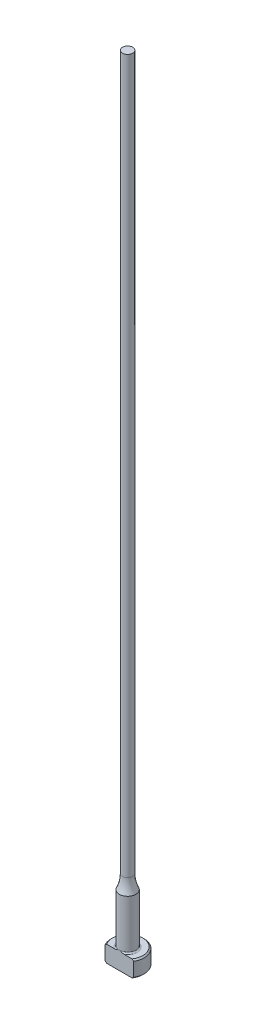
from build123d import *

# Parameters (mm, degrees)
CHAMFER1_SIZE      = 0.254
FILLET1_R          = 0.254
CUT_EXTRUDE1_DEPTH = 153.466131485


with BuildPart() as part:
    # Sketch1 → Revolve1 (revolve)
    with BuildSketch(Plane.XY, mode=Mode.PRIVATE) as revolve1_sk:
        with BuildLine():
            Line((0, 0), (-3.175, 0))
            Line((-3.175, 0), (-3.175, 3.175))
            Line((-3.175, 3.175), (-1.5875, 3.175))
            Line((-1.5875, 3.175), (-1.5875, 12.7))
            ThreePointArc((-1.5875, 12.7), (-1.142565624, 14.009911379), (-0.99187, 15.385093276))
            Line((-0.99187, 15.385093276), (-0.99187, 152.4))
            Line((-0.99187, 152.4), (0, 152.4))
            Line((0, 152.4), (0, 0))
        make_face()
    revolve(revolve1_sk.sketch.rotate(Axis((0, 259.958771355, 0), (0, -1, 0)), 270), axis=Axis((0, 259.958771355, 0), (0, -1, 0)))

    # Chamfer1
    chamfer1_edges = [part.edges().sort_by_distance(p)[0] for p in [
        (0, 0, -3.175),
        (0, 3.175, -3.175),
    ]]
    chamfer(chamfer1_edges, length=CHAMFER1_SIZE)

    # Fillet1
    fillet1_edges = [part.edges().sort_by_distance(p)[0] for p in [
        (0, 3.175, -1.5875),
    ]]
    fillet(fillet1_edges, radius=FILLET1_R)

    # Sketch2 → Cut-Extrude1 (cut, through all)
    with BuildSketch(Plane.XZ):
        with BuildLine():
            Line((-2.749630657, 1.5875), (2.749630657, 1.5875))
            ThreePointArc((2.749630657, 1.5875), (0, 3.175), (-2.749630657, 1.5875))
        make_face()
    extrude(amount=-CUT_EXTRUDE1_DEPTH, mode=Mode.SUBTRACT)


solid = part.part
